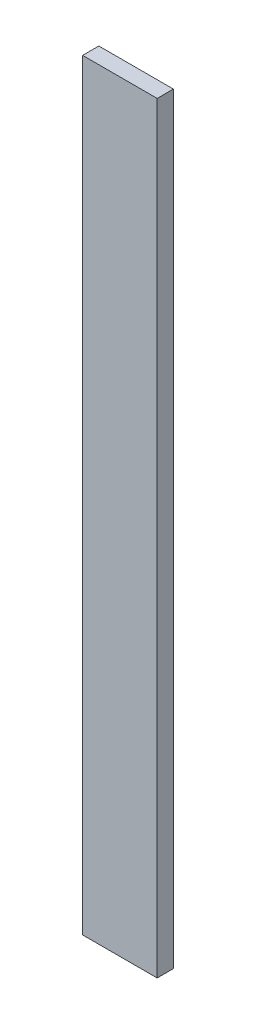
from build123d import *

# Parameters (mm, degrees)
SKETCH1_W           = 2.3
SKETCH1_H           = 23.5
BOSS_EXTRUDE1_DEPTH = 0.5


with BuildPart() as part:
    # Sketch1 → Boss-Extrude1 (new body)
    with BuildSketch(Plane.XY):
        Rectangle(SKETCH1_W, SKETCH1_H)
    extrude(amount=-BOSS_EXTRUDE1_DEPTH)


solid = part.part
